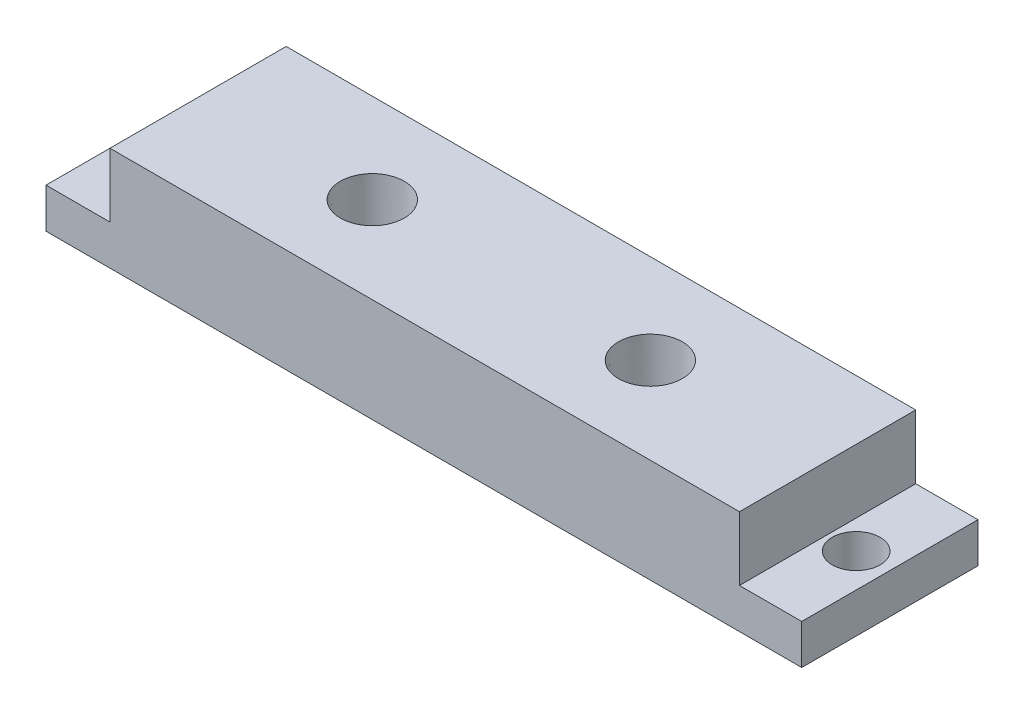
ISO-10303-21;
HEADER;
FILE_DESCRIPTION(('STEP AP214'),'2;1');
FILE_NAME('part.step','',(''),(''),'','','');
FILE_SCHEMA(('AUTOMOTIVE_DESIGN { 1 0 10303 214 1 1 1 1 }'));
ENDSEC;
DATA;
#1=APPLICATION_CONTEXT('core data for automotive mechanical design processes');
#2=APPLICATION_PROTOCOL_DEFINITION('international standard','automotive_design',2000,#1);
#3=PRODUCT_CONTEXT('',#1,'mechanical');
#4=PRODUCT('Part','Part','',(#3));
#5=PRODUCT_RELATED_PRODUCT_CATEGORY('part','',(#4));
#6=PRODUCT_DEFINITION_FORMATION('','',#4);
#7=PRODUCT_DEFINITION_CONTEXT('part definition',#1,'design');
#8=PRODUCT_DEFINITION('design','',#6,#7);
#9=PRODUCT_DEFINITION_SHAPE('','',#8);
#10=(LENGTH_UNIT() NAMED_UNIT(*) SI_UNIT(.MILLI.,.METRE.));
#11=(NAMED_UNIT(*) PLANE_ANGLE_UNIT() SI_UNIT($,.RADIAN.));
#12=(NAMED_UNIT(*) SI_UNIT($,.STERADIAN.) SOLID_ANGLE_UNIT());
#13=UNCERTAINTY_MEASURE_WITH_UNIT(LENGTH_MEASURE(1.E-05),#10,'distance_accuracy_value','');
#14=(GEOMETRIC_REPRESENTATION_CONTEXT(3) GLOBAL_UNCERTAINTY_ASSIGNED_CONTEXT((#13)) GLOBAL_UNIT_ASSIGNED_CONTEXT((#10,
#11,#12)) REPRESENTATION_CONTEXT('',''));
#15=CARTESIAN_POINT('',(0.,0.,0.));
#16=DIRECTION('',(0.,0.,1.));
#17=DIRECTION('',(1.,0.,0.));
#18=AXIS2_PLACEMENT_3D('',#15,#16,#17);
#19=CARTESIAN_POINT('',(-112.70272222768,13.,7.22130923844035));
#20=DIRECTION('',(0.,1.,0.));
#21=DIRECTION('',(0.,0.,1.));
#22=AXIS2_PLACEMENT_3D('',#19,#20,#21);
#23=PLANE('',#22);
#24=DIRECTION('',(0.,0.,1.));
#25=VECTOR('',#24,1.);
#26=CARTESIAN_POINT('',(2.50715548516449,13.,-3.81233545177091));
#27=LINE('',#26,#25);
#28=CARTESIAN_POINT('',(2.50715548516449,13.,-3.81233545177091));
#29=VERTEX_POINT('',#28);
#30=CARTESIAN_POINT('',(2.50715548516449,13.,18.2549539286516));
#31=VERTEX_POINT('',#30);
#32=EDGE_CURVE('E104',#29,#31,#27,.T.);
#33=ORIENTED_EDGE('',*,*,#32,.F.);
#34=DIRECTION('',(1.,0.,0.));
#35=VECTOR('',#34,1.);
#36=CARTESIAN_POINT('',(-112.70272222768,13.,-3.81233545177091));
#37=LINE('',#36,#35);
#38=CARTESIAN_POINT('',(-76.3031514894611,13.,-3.81233545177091));
#39=VERTEX_POINT('',#38);
#40=EDGE_CURVE('E146',#39,#29,#37,.T.);
#41=ORIENTED_EDGE('',*,*,#40,.F.);
#42=DIRECTION('',(0.,0.,1.));
#43=VECTOR('',#42,1.);
#44=CARTESIAN_POINT('',(-76.3031514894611,13.,7.22130923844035));
#45=LINE('',#44,#43);
#46=CARTESIAN_POINT('',(-76.3031514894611,13.,18.2549539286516));
#47=VERTEX_POINT('',#46);
#48=EDGE_CURVE('E125',#39,#47,#45,.T.);
#49=ORIENTED_EDGE('',*,*,#48,.T.);
#50=DIRECTION('',(1.,0.,0.));
#51=VECTOR('',#50,1.);
#52=CARTESIAN_POINT('',(-112.70272222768,13.,18.2549539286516));
#53=LINE('',#52,#51);
#54=EDGE_CURVE('E144',#47,#31,#53,.T.);
#55=ORIENTED_EDGE('',*,*,#54,.T.);
#56=EDGE_LOOP('',(#33,#41,#49,#55));
#57=FACE_BOUND('',#56,.T.);
#58=CARTESIAN_POINT('',(-54.3031514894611,13.,7.40763824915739));
#59=DIRECTION('',(0.,1.,0.));
#60=DIRECTION('',(0.,0.,1.));
#61=AXIS2_PLACEMENT_3D('',#58,#59,#60);
#62=CIRCLE('',#61,4.00000000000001);
#63=CARTESIAN_POINT('',(-54.3031514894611,13.,11.4076382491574));
#64=VERTEX_POINT('',#63);
#65=EDGE_CURVE('E201',#64,#64,#62,.T.);
#66=ORIENTED_EDGE('',*,*,#65,.F.);
#67=EDGE_LOOP('',(#66));
#68=FACE_BOUND('',#67,.T.);
#69=CARTESIAN_POINT('',(-19.4928445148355,13.,7.40763824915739));
#70=DIRECTION('',(0.,-1.,0.));
#71=DIRECTION('',(0.,0.,-1.));
#72=AXIS2_PLACEMENT_3D('',#69,#70,#71);
#73=CIRCLE('',#72,4.00000000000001);
#74=CARTESIAN_POINT('',(-19.4928445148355,13.,3.40763824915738));
#75=VERTEX_POINT('',#74);
#76=EDGE_CURVE('E204',#75,#75,#73,.T.);
#77=ORIENTED_EDGE('',*,*,#76,.T.);
#78=EDGE_LOOP('',(#77));
#79=FACE_BOUND('',#78,.T.);
#80=ADVANCED_FACE('F33',(#57,#68,#79),#23,.T.);
#81=CARTESIAN_POINT('',(10.3014272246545,13.,7.22130923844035));
#82=DIRECTION('',(1.,0.,0.));
#83=DIRECTION('',(0.,0.,-1.));
#84=AXIS2_PLACEMENT_3D('',#81,#82,#83);
#85=PLANE('',#84);
#86=DIRECTION('',(0.,-1.,0.));
#87=VECTOR('',#86,1.);
#88=CARTESIAN_POINT('',(10.3014272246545,13.,-3.81233545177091));
#89=LINE('',#88,#87);
#90=CARTESIAN_POINT('',(10.3014272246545,5.,-3.81233545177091));
#91=VERTEX_POINT('',#90);
#92=CARTESIAN_POINT('',(10.3014272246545,0.,-3.81233545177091));
#93=VERTEX_POINT('',#92);
#94=EDGE_CURVE('E42',#91,#93,#89,.T.);
#95=ORIENTED_EDGE('',*,*,#94,.F.);
#96=DIRECTION('',(0.,0.,1.));
#97=VECTOR('',#96,1.);
#98=CARTESIAN_POINT('',(10.3014272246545,5.,7.22130923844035));
#99=LINE('',#98,#97);
#100=CARTESIAN_POINT('',(10.3014272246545,5.,18.2549539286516));
#101=VERTEX_POINT('',#100);
#102=EDGE_CURVE('E123',#91,#101,#99,.T.);
#103=ORIENTED_EDGE('',*,*,#102,.T.);
#104=DIRECTION('',(0.,-1.,0.));
#105=VECTOR('',#104,1.);
#106=CARTESIAN_POINT('',(10.3014272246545,13.,18.2549539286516));
#107=LINE('',#106,#105);
#108=CARTESIAN_POINT('',(10.3014272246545,0.,18.2549539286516));
#109=VERTEX_POINT('',#108);
#110=EDGE_CURVE('E11',#101,#109,#107,.T.);
#111=ORIENTED_EDGE('',*,*,#110,.T.);
#112=DIRECTION('',(0.,0.,1.));
#113=VECTOR('',#112,1.);
#114=CARTESIAN_POINT('',(10.3014272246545,0.,7.22130923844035));
#115=LINE('',#114,#113);
#116=EDGE_CURVE('E152',#93,#109,#115,.T.);
#117=ORIENTED_EDGE('',*,*,#116,.F.);
#118=EDGE_LOOP('',(#95,#103,#111,#117));
#119=FACE_BOUND('',#118,.T.);
#120=ADVANCED_FACE('F176',(#119),#85,.T.);
#121=CARTESIAN_POINT('',(6.08136965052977,13.,7.22130923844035));
#122=DIRECTION('',(0.,-1.,0.));
#123=DIRECTION('',(0.,0.,-1.));
#124=AXIS2_PLACEMENT_3D('',#121,#122,#123);
#125=CYLINDRICAL_SURFACE('',#124,3.);
#126=CARTESIAN_POINT('',(6.08136965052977,0.,7.22130923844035));
#127=DIRECTION('',(0.,1.,0.));
#128=DIRECTION('',(0.,0.,1.));
#129=AXIS2_PLACEMENT_3D('',#126,#127,#128);
#130=CIRCLE('',#129,3.);
#131=CARTESIAN_POINT('',(6.08136965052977,0.,4.22130923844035));
#132=VERTEX_POINT('',#131);
#133=EDGE_CURVE('E147',#132,#132,#130,.T.);
#134=CARTESIAN_POINT('',(6.08136965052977,5.,7.22130923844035));
#135=DIRECTION('',(0.,1.,0.));
#136=DIRECTION('',(0.,0.,1.));
#137=AXIS2_PLACEMENT_3D('',#134,#135,#136);
#138=CIRCLE('',#137,3.);
#139=CARTESIAN_POINT('',(6.08136965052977,5.,4.22130923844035));
#140=VERTEX_POINT('',#139);
#141=EDGE_CURVE('E37',#140,#140,#138,.T.);
#142=CARTESIAN_POINT('',(6.08136965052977,0.,4.22130923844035));
#143=CARTESIAN_POINT('',(6.08136965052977,0.0520833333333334,4.22130923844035));
#144=CARTESIAN_POINT('',(6.08136965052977,0.104166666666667,4.22130923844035));
#145=CARTESIAN_POINT('',(6.08136965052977,0.208333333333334,4.22130923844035));
#146=CARTESIAN_POINT('',(6.08136965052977,0.260416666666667,4.22130923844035));
#147=CARTESIAN_POINT('',(6.08136965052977,0.364583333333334,4.22130923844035));
#148=CARTESIAN_POINT('',(6.08136965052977,0.416666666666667,4.22130923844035));
#149=CARTESIAN_POINT('',(6.08136965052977,0.520833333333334,4.22130923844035));
#150=CARTESIAN_POINT('',(6.08136965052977,0.572916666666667,4.22130923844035));
#151=CARTESIAN_POINT('',(6.08136965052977,0.677083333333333,4.22130923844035));
#152=CARTESIAN_POINT('',(6.08136965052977,0.729166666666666,4.22130923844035));
#153=CARTESIAN_POINT('',(6.08136965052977,0.833333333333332,4.22130923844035));
#154=CARTESIAN_POINT('',(6.08136965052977,0.885416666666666,4.22130923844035));
#155=CARTESIAN_POINT('',(6.08136965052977,0.989583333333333,4.22130923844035));
#156=CARTESIAN_POINT('',(6.08136965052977,1.04166666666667,4.22130923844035));
#157=CARTESIAN_POINT('',(6.08136965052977,1.14583333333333,4.22130923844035));
#158=CARTESIAN_POINT('',(6.08136965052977,1.19791666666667,4.22130923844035));
#159=CARTESIAN_POINT('',(6.08136965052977,1.30208333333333,4.22130923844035));
#160=CARTESIAN_POINT('',(6.08136965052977,1.35416666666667,4.22130923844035));
#161=CARTESIAN_POINT('',(6.08136965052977,1.45833333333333,4.22130923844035));
#162=CARTESIAN_POINT('',(6.08136965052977,1.51041666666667,4.22130923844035));
#163=CARTESIAN_POINT('',(6.08136965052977,1.61458333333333,4.22130923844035));
#164=CARTESIAN_POINT('',(6.08136965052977,1.66666666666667,4.22130923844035));
#165=CARTESIAN_POINT('',(6.08136965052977,1.77083333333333,4.22130923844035));
#166=CARTESIAN_POINT('',(6.08136965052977,1.82291666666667,4.22130923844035));
#167=CARTESIAN_POINT('',(6.08136965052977,1.92708333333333,4.22130923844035));
#168=CARTESIAN_POINT('',(6.08136965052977,1.97916666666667,4.22130923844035));
#169=CARTESIAN_POINT('',(6.08136965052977,2.08333333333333,4.22130923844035));
#170=CARTESIAN_POINT('',(6.08136965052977,2.13541666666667,4.22130923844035));
#171=CARTESIAN_POINT('',(6.08136965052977,2.23958333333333,4.22130923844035));
#172=CARTESIAN_POINT('',(6.08136965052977,2.29166666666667,4.22130923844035));
#173=CARTESIAN_POINT('',(6.08136965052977,2.39583333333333,4.22130923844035));
#174=CARTESIAN_POINT('',(6.08136965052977,2.44791666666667,4.22130923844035));
#175=CARTESIAN_POINT('',(6.08136965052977,2.55208333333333,4.22130923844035));
#176=CARTESIAN_POINT('',(6.08136965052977,2.60416666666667,4.22130923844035));
#177=CARTESIAN_POINT('',(6.08136965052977,2.70833333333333,4.22130923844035));
#178=CARTESIAN_POINT('',(6.08136965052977,2.76041666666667,4.22130923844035));
#179=CARTESIAN_POINT('',(6.08136965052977,2.86458333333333,4.22130923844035));
#180=CARTESIAN_POINT('',(6.08136965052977,2.91666666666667,4.22130923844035));
#181=CARTESIAN_POINT('',(6.08136965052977,3.02083333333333,4.22130923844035));
#182=CARTESIAN_POINT('',(6.08136965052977,3.07291666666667,4.22130923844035));
#183=CARTESIAN_POINT('',(6.08136965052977,3.17708333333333,4.22130923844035));
#184=CARTESIAN_POINT('',(6.08136965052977,3.22916666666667,4.22130923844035));
#185=CARTESIAN_POINT('',(6.08136965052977,3.33333333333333,4.22130923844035));
#186=CARTESIAN_POINT('',(6.08136965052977,3.38541666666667,4.22130923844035));
#187=CARTESIAN_POINT('',(6.08136965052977,3.48958333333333,4.22130923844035));
#188=CARTESIAN_POINT('',(6.08136965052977,3.54166666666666,4.22130923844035));
#189=CARTESIAN_POINT('',(6.08136965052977,3.64583333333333,4.22130923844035));
#190=CARTESIAN_POINT('',(6.08136965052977,3.69791666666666,4.22130923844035));
#191=CARTESIAN_POINT('',(6.08136965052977,3.80208333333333,4.22130923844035));
#192=CARTESIAN_POINT('',(6.08136965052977,3.85416666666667,4.22130923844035));
#193=CARTESIAN_POINT('',(6.08136965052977,3.95833333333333,4.22130923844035));
#194=CARTESIAN_POINT('',(6.08136965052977,4.01041666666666,4.22130923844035));
#195=CARTESIAN_POINT('',(6.08136965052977,4.11458333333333,4.22130923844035));
#196=CARTESIAN_POINT('',(6.08136965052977,4.16666666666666,4.22130923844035));
#197=CARTESIAN_POINT('',(6.08136965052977,4.27083333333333,4.22130923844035));
#198=CARTESIAN_POINT('',(6.08136965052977,4.32291666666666,4.22130923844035));
#199=CARTESIAN_POINT('',(6.08136965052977,4.42708333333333,4.22130923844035));
#200=CARTESIAN_POINT('',(6.08136965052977,4.47916666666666,4.22130923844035));
#201=CARTESIAN_POINT('',(6.08136965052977,4.58333333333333,4.22130923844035));
#202=CARTESIAN_POINT('',(6.08136965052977,4.63541666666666,4.22130923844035));
#203=CARTESIAN_POINT('',(6.08136965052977,4.73958333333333,4.22130923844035));
#204=CARTESIAN_POINT('',(6.08136965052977,4.79166666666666,4.22130923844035));
#205=CARTESIAN_POINT('',(6.08136965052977,4.89583333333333,4.22130923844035));
#206=CARTESIAN_POINT('',(6.08136965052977,4.94791666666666,4.22130923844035));
#207=CARTESIAN_POINT('',(6.08136965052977,5.,4.22130923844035));
#208=B_SPLINE_CURVE_WITH_KNOTS('',3,(#142,#143,#144,#145,#146,#147,#148,#149,#150,#151,#152,
#153,#154,#155,#156,#157,#158,#159,#160,#161,#162,#163,#164,#165,#166,#167,#168,#169,#170,#171,
#172,#173,#174,#175,#176,#177,#178,#179,#180,#181,#182,#183,#184,#185,#186,#187,#188,#189,#190,
#191,#192,#193,#194,#195,#196,#197,#198,#199,#200,#201,#202,#203,#204,#205,#206,#207),
.UNSPECIFIED.,.F.,.F.,(4,2,2,2,2,2,2,2,2,2,2,2,2,2,2,2,2,2,2,2,2,2,2,2,2,2,2,2,2,2,2,2,4),(0.,
0.15625,0.3125,0.46875,0.625000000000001,0.781249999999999,0.937499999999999,1.09375,1.25,
1.40625,1.5625,1.71875,1.875,2.03125,2.1875,2.34375,2.5,2.65625,2.8125,2.96875,3.125,3.28125,
3.4375,3.59375,3.75,3.90625,4.0625,4.21875,4.375,4.53125,4.6875,4.84375,5.),.UNSPECIFIED.);
#209=EDGE_CURVE('BSEAM238',#132,#140,#208,.T.);
#210=ORIENTED_EDGE('',*,*,#133,.F.);
#211=ORIENTED_EDGE('',*,*,#141,.T.);
#212=ORIENTED_EDGE('',*,*,#209,.T.);
#213=ORIENTED_EDGE('',*,*,#209,.F.);
#214=EDGE_LOOP('',(#210,#212,#211,#213));
#215=FACE_BOUND('',#214,.T.);
#216=ADVANCED_FACE('F238',(#215),#125,.F.);
#217=CARTESIAN_POINT('',(-112.70272222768,13.,18.2549539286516));
#218=DIRECTION('',(0.,0.,-1.));
#219=DIRECTION('',(-1.,0.,0.));
#220=AXIS2_PLACEMENT_3D('',#217,#218,#219);
#221=PLANE('',#220);
#222=DIRECTION('',(1.,0.,0.));
#223=VECTOR('',#222,1.);
#224=CARTESIAN_POINT('',(2.50715548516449,5.,18.2549539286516));
#225=LINE('',#224,#223);
#226=CARTESIAN_POINT('',(2.50715548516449,5.,18.2549539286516));
#227=VERTEX_POINT('',#226);
#228=EDGE_CURVE('E49',#227,#101,#225,.T.);
#229=ORIENTED_EDGE('',*,*,#228,.F.);
#230=DIRECTION('',(0.,1.,0.));
#231=VECTOR('',#230,1.);
#232=CARTESIAN_POINT('',(2.50715548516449,5.,18.2549539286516));
#233=LINE('',#232,#231);
#234=EDGE_CURVE('E99',#227,#31,#233,.T.);
#235=ORIENTED_EDGE('',*,*,#234,.T.);
#236=ORIENTED_EDGE('',*,*,#54,.F.);
#237=DIRECTION('',(0.,1.,0.));
#238=VECTOR('',#237,1.);
#239=CARTESIAN_POINT('',(-76.3031514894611,5.,18.2549539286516));
#240=LINE('',#239,#238);
#241=CARTESIAN_POINT('',(-76.3031514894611,5.,18.2549539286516));
#242=VERTEX_POINT('',#241);
#243=EDGE_CURVE('E57',#242,#47,#240,.T.);
#244=ORIENTED_EDGE('',*,*,#243,.F.);
#245=DIRECTION('',(1.,0.,0.));
#246=VECTOR('',#245,1.);
#247=CARTESIAN_POINT('',(-112.70272222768,5.,18.2549539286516));
#248=LINE('',#247,#246);
#249=CARTESIAN_POINT('',(-84.3031514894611,5.,18.2549539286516));
#250=VERTEX_POINT('',#249);
#251=EDGE_CURVE('E132',#250,#242,#248,.T.);
#252=ORIENTED_EDGE('',*,*,#251,.F.);
#253=DIRECTION('',(0.,-1.,0.));
#254=VECTOR('',#253,1.);
#255=CARTESIAN_POINT('',(-84.3031514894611,13.,18.2549539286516));
#256=LINE('',#255,#254);
#257=CARTESIAN_POINT('',(-84.3031514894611,0.,18.2549539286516));
#258=VERTEX_POINT('',#257);
#259=EDGE_CURVE('E150',#250,#258,#256,.T.);
#260=ORIENTED_EDGE('',*,*,#259,.T.);
#261=DIRECTION('',(1.,0.,0.));
#262=VECTOR('',#261,1.);
#263=CARTESIAN_POINT('',(-112.70272222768,0.,18.2549539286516));
#264=LINE('',#263,#262);
#265=EDGE_CURVE('E141',#258,#109,#264,.T.);
#266=ORIENTED_EDGE('',*,*,#265,.T.);
#267=ORIENTED_EDGE('',*,*,#110,.F.);
#268=EDGE_LOOP('',(#229,#235,#236,#244,#252,#260,#266,#267));
#269=FACE_BOUND('',#268,.T.);
#270=ADVANCED_FACE('F35',(#269),#221,.F.);
#271=CARTESIAN_POINT('',(-112.70272222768,13.,-3.81233545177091));
#272=DIRECTION('',(0.,0.,-1.));
#273=DIRECTION('',(-1.,0.,0.));
#274=AXIS2_PLACEMENT_3D('',#271,#272,#273);
#275=PLANE('',#274);
#276=DIRECTION('',(0.,1.,0.));
#277=VECTOR('',#276,1.);
#278=CARTESIAN_POINT('',(2.50715548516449,5.,-3.81233545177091));
#279=LINE('',#278,#277);
#280=CARTESIAN_POINT('',(2.50715548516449,5.,-3.81233545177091));
#281=VERTEX_POINT('',#280);
#282=EDGE_CURVE('E108',#281,#29,#279,.T.);
#283=ORIENTED_EDGE('',*,*,#282,.F.);
#284=DIRECTION('',(-1.,0.,0.));
#285=VECTOR('',#284,1.);
#286=CARTESIAN_POINT('',(2.50715548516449,5.,-3.81233545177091));
#287=LINE('',#286,#285);
#288=EDGE_CURVE('E109',#91,#281,#287,.T.);
#289=ORIENTED_EDGE('',*,*,#288,.F.);
#290=ORIENTED_EDGE('',*,*,#94,.T.);
#291=DIRECTION('',(1.,0.,0.));
#292=VECTOR('',#291,1.);
#293=CARTESIAN_POINT('',(-112.70272222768,0.,-3.81233545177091));
#294=LINE('',#293,#292);
#295=CARTESIAN_POINT('',(-84.3031514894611,0.,-3.81233545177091));
#296=VERTEX_POINT('',#295);
#297=EDGE_CURVE('E155',#296,#93,#294,.T.);
#298=ORIENTED_EDGE('',*,*,#297,.F.);
#299=DIRECTION('',(0.,-1.,0.));
#300=VECTOR('',#299,1.);
#301=CARTESIAN_POINT('',(-84.3031514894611,13.,-3.81233545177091));
#302=LINE('',#301,#300);
#303=CARTESIAN_POINT('',(-84.3031514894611,5.,-3.81233545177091));
#304=VERTEX_POINT('',#303);
#305=EDGE_CURVE('E167',#304,#296,#302,.T.);
#306=ORIENTED_EDGE('',*,*,#305,.F.);
#307=DIRECTION('',(-1.,0.,0.));
#308=VECTOR('',#307,1.);
#309=CARTESIAN_POINT('',(-112.70272222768,5.,-3.81233545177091));
#310=LINE('',#309,#308);
#311=CARTESIAN_POINT('',(-76.3031514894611,5.,-3.81233545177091));
#312=VERTEX_POINT('',#311);
#313=EDGE_CURVE('E128',#312,#304,#310,.T.);
#314=ORIENTED_EDGE('',*,*,#313,.F.);
#315=DIRECTION('',(0.,1.,0.));
#316=VECTOR('',#315,1.);
#317=CARTESIAN_POINT('',(-76.3031514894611,5.,-3.81233545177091));
#318=LINE('',#317,#316);
#319=EDGE_CURVE('E138',#312,#39,#318,.T.);
#320=ORIENTED_EDGE('',*,*,#319,.T.);
#321=ORIENTED_EDGE('',*,*,#40,.T.);
#322=EDGE_LOOP('',(#283,#289,#290,#298,#306,#314,#320,#321));
#323=FACE_BOUND('',#322,.T.);
#324=ADVANCED_FACE('F173',(#323),#275,.T.);
#325=CARTESIAN_POINT('',(-80.1837497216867,13.,7.22130923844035));
#326=DIRECTION('',(0.,-1.,0.));
#327=DIRECTION('',(0.,0.,-1.));
#328=AXIS2_PLACEMENT_3D('',#325,#326,#327);
#329=CYLINDRICAL_SURFACE('',#328,3.03623271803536);
#330=CARTESIAN_POINT('',(-80.1837497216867,0.,7.22130923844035));
#331=DIRECTION('',(0.,1.,0.));
#332=DIRECTION('',(0.,0.,1.));
#333=AXIS2_PLACEMENT_3D('',#330,#331,#332);
#334=CIRCLE('',#333,3.03623271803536);
#335=CARTESIAN_POINT('',(-80.1837497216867,0.,4.18507652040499));
#336=VERTEX_POINT('',#335);
#337=EDGE_CURVE('E161',#336,#336,#334,.T.);
#338=CARTESIAN_POINT('',(-80.1837497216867,5.,7.22130923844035));
#339=DIRECTION('',(0.,1.,0.));
#340=DIRECTION('',(0.,0.,1.));
#341=AXIS2_PLACEMENT_3D('',#338,#339,#340);
#342=CIRCLE('',#341,3.03623271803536);
#343=CARTESIAN_POINT('',(-80.1837497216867,5.,4.18507652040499));
#344=VERTEX_POINT('',#343);
#345=EDGE_CURVE('E135',#344,#344,#342,.F.);
#346=CARTESIAN_POINT('',(-80.1837497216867,0.,4.18507652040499));
#347=CARTESIAN_POINT('',(-80.1837497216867,0.0520833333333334,4.18507652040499));
#348=CARTESIAN_POINT('',(-80.1837497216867,0.104166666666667,4.18507652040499));
#349=CARTESIAN_POINT('',(-80.1837497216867,0.208333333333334,4.18507652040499));
#350=CARTESIAN_POINT('',(-80.1837497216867,0.260416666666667,4.18507652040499));
#351=CARTESIAN_POINT('',(-80.1837497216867,0.364583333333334,4.18507652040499));
#352=CARTESIAN_POINT('',(-80.1837497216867,0.416666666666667,4.18507652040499));
#353=CARTESIAN_POINT('',(-80.1837497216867,0.520833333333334,4.18507652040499));
#354=CARTESIAN_POINT('',(-80.1837497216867,0.572916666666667,4.18507652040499));
#355=CARTESIAN_POINT('',(-80.1837497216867,0.677083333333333,4.18507652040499));
#356=CARTESIAN_POINT('',(-80.1837497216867,0.729166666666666,4.18507652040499));
#357=CARTESIAN_POINT('',(-80.1837497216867,0.833333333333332,4.18507652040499));
#358=CARTESIAN_POINT('',(-80.1837497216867,0.885416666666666,4.18507652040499));
#359=CARTESIAN_POINT('',(-80.1837497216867,0.989583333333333,4.18507652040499));
#360=CARTESIAN_POINT('',(-80.1837497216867,1.04166666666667,4.18507652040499));
#361=CARTESIAN_POINT('',(-80.1837497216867,1.14583333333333,4.18507652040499));
#362=CARTESIAN_POINT('',(-80.1837497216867,1.19791666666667,4.18507652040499));
#363=CARTESIAN_POINT('',(-80.1837497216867,1.30208333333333,4.18507652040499));
#364=CARTESIAN_POINT('',(-80.1837497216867,1.35416666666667,4.18507652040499));
#365=CARTESIAN_POINT('',(-80.1837497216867,1.45833333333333,4.18507652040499));
#366=CARTESIAN_POINT('',(-80.1837497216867,1.51041666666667,4.18507652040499));
#367=CARTESIAN_POINT('',(-80.1837497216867,1.61458333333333,4.18507652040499));
#368=CARTESIAN_POINT('',(-80.1837497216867,1.66666666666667,4.18507652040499));
#369=CARTESIAN_POINT('',(-80.1837497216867,1.77083333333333,4.18507652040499));
#370=CARTESIAN_POINT('',(-80.1837497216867,1.82291666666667,4.18507652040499));
#371=CARTESIAN_POINT('',(-80.1837497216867,1.92708333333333,4.18507652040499));
#372=CARTESIAN_POINT('',(-80.1837497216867,1.97916666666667,4.18507652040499));
#373=CARTESIAN_POINT('',(-80.1837497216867,2.08333333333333,4.18507652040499));
#374=CARTESIAN_POINT('',(-80.1837497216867,2.13541666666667,4.18507652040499));
#375=CARTESIAN_POINT('',(-80.1837497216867,2.23958333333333,4.18507652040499));
#376=CARTESIAN_POINT('',(-80.1837497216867,2.29166666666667,4.18507652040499));
#377=CARTESIAN_POINT('',(-80.1837497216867,2.39583333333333,4.18507652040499));
#378=CARTESIAN_POINT('',(-80.1837497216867,2.44791666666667,4.18507652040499));
#379=CARTESIAN_POINT('',(-80.1837497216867,2.55208333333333,4.18507652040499));
#380=CARTESIAN_POINT('',(-80.1837497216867,2.60416666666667,4.18507652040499));
#381=CARTESIAN_POINT('',(-80.1837497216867,2.70833333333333,4.18507652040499));
#382=CARTESIAN_POINT('',(-80.1837497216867,2.76041666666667,4.18507652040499));
#383=CARTESIAN_POINT('',(-80.1837497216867,2.86458333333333,4.18507652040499));
#384=CARTESIAN_POINT('',(-80.1837497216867,2.91666666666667,4.18507652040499));
#385=CARTESIAN_POINT('',(-80.1837497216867,3.02083333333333,4.18507652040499));
#386=CARTESIAN_POINT('',(-80.1837497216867,3.07291666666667,4.18507652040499));
#387=CARTESIAN_POINT('',(-80.1837497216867,3.17708333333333,4.18507652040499));
#388=CARTESIAN_POINT('',(-80.1837497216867,3.22916666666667,4.18507652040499));
#389=CARTESIAN_POINT('',(-80.1837497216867,3.33333333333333,4.18507652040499));
#390=CARTESIAN_POINT('',(-80.1837497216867,3.38541666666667,4.18507652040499));
#391=CARTESIAN_POINT('',(-80.1837497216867,3.48958333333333,4.18507652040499));
#392=CARTESIAN_POINT('',(-80.1837497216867,3.54166666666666,4.18507652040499));
#393=CARTESIAN_POINT('',(-80.1837497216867,3.64583333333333,4.18507652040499));
#394=CARTESIAN_POINT('',(-80.1837497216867,3.69791666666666,4.18507652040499));
#395=CARTESIAN_POINT('',(-80.1837497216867,3.80208333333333,4.18507652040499));
#396=CARTESIAN_POINT('',(-80.1837497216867,3.85416666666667,4.18507652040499));
#397=CARTESIAN_POINT('',(-80.1837497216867,3.95833333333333,4.18507652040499));
#398=CARTESIAN_POINT('',(-80.1837497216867,4.01041666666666,4.18507652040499));
#399=CARTESIAN_POINT('',(-80.1837497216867,4.11458333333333,4.18507652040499));
#400=CARTESIAN_POINT('',(-80.1837497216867,4.16666666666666,4.18507652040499));
#401=CARTESIAN_POINT('',(-80.1837497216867,4.27083333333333,4.18507652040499));
#402=CARTESIAN_POINT('',(-80.1837497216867,4.32291666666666,4.18507652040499));
#403=CARTESIAN_POINT('',(-80.1837497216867,4.42708333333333,4.18507652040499));
#404=CARTESIAN_POINT('',(-80.1837497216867,4.47916666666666,4.18507652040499));
#405=CARTESIAN_POINT('',(-80.1837497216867,4.58333333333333,4.18507652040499));
#406=CARTESIAN_POINT('',(-80.1837497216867,4.63541666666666,4.18507652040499));
#407=CARTESIAN_POINT('',(-80.1837497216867,4.73958333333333,4.18507652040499));
#408=CARTESIAN_POINT('',(-80.1837497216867,4.79166666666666,4.18507652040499));
#409=CARTESIAN_POINT('',(-80.1837497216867,4.89583333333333,4.18507652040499));
#410=CARTESIAN_POINT('',(-80.1837497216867,4.94791666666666,4.18507652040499));
#411=CARTESIAN_POINT('',(-80.1837497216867,5.,4.18507652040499));
#412=B_SPLINE_CURVE_WITH_KNOTS('',3,(#346,#347,#348,#349,#350,#351,#352,#353,#354,#355,#356,
#357,#358,#359,#360,#361,#362,#363,#364,#365,#366,#367,#368,#369,#370,#371,#372,#373,#374,#375,
#376,#377,#378,#379,#380,#381,#382,#383,#384,#385,#386,#387,#388,#389,#390,#391,#392,#393,#394,
#395,#396,#397,#398,#399,#400,#401,#402,#403,#404,#405,#406,#407,#408,#409,#410,#411),
.UNSPECIFIED.,.F.,.F.,(4,2,2,2,2,2,2,2,2,2,2,2,2,2,2,2,2,2,2,2,2,2,2,2,2,2,2,2,2,2,2,2,4),(0.,
0.15625,0.3125,0.46875,0.625000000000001,0.781249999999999,0.937499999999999,1.09375,1.25,
1.40625,1.5625,1.71875,1.875,2.03125,2.1875,2.34375,2.5,2.65625,2.8125,2.96875,3.125,3.28125,
3.4375,3.59375,3.75,3.90625,4.0625,4.21875,4.375,4.53125,4.6875,4.84375,5.),.UNSPECIFIED.);
#413=EDGE_CURVE('BSEAM242',#336,#344,#412,.T.);
#414=ORIENTED_EDGE('',*,*,#337,.F.);
#415=ORIENTED_EDGE('',*,*,#345,.F.);
#416=ORIENTED_EDGE('',*,*,#413,.T.);
#417=ORIENTED_EDGE('',*,*,#413,.F.);
#418=EDGE_LOOP('',(#414,#416,#415,#417));
#419=FACE_BOUND('',#418,.T.);
#420=ADVANCED_FACE('F242',(#419),#329,.F.);
#421=CARTESIAN_POINT('',(-84.3031514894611,13.,7.22130923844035));
#422=DIRECTION('',(1.,0.,0.));
#423=DIRECTION('',(0.,0.,-1.));
#424=AXIS2_PLACEMENT_3D('',#421,#422,#423);
#425=PLANE('',#424);
#426=DIRECTION('',(0.,0.,1.));
#427=VECTOR('',#426,1.);
#428=CARTESIAN_POINT('',(-84.3031514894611,5.,7.22130923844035));
#429=LINE('',#428,#427);
#430=EDGE_CURVE('E130',#304,#250,#429,.T.);
#431=ORIENTED_EDGE('',*,*,#430,.F.);
#432=ORIENTED_EDGE('',*,*,#305,.T.);
#433=DIRECTION('',(0.,0.,1.));
#434=VECTOR('',#433,1.);
#435=CARTESIAN_POINT('',(-84.3031514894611,0.,7.22130923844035));
#436=LINE('',#435,#434);
#437=EDGE_CURVE('E158',#296,#258,#436,.T.);
#438=ORIENTED_EDGE('',*,*,#437,.T.);
#439=ORIENTED_EDGE('',*,*,#259,.F.);
#440=EDGE_LOOP('',(#431,#432,#438,#439));
#441=FACE_BOUND('',#440,.T.);
#442=ADVANCED_FACE('F185',(#441),#425,.F.);
#443=CARTESIAN_POINT('',(-112.70272222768,0.,7.22130923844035));
#444=DIRECTION('',(0.,1.,0.));
#445=DIRECTION('',(0.,0.,1.));
#446=AXIS2_PLACEMENT_3D('',#443,#444,#445);
#447=PLANE('',#446);
#448=ORIENTED_EDGE('',*,*,#265,.F.);
#449=ORIENTED_EDGE('',*,*,#437,.F.);
#450=ORIENTED_EDGE('',*,*,#297,.T.);
#451=ORIENTED_EDGE('',*,*,#116,.T.);
#452=EDGE_LOOP('',(#448,#449,#450,#451));
#453=FACE_BOUND('',#452,.T.);
#454=ORIENTED_EDGE('',*,*,#337,.T.);
#455=EDGE_LOOP('',(#454));
#456=FACE_BOUND('',#455,.T.);
#457=ORIENTED_EDGE('',*,*,#133,.T.);
#458=EDGE_LOOP('',(#457));
#459=FACE_BOUND('',#458,.T.);
#460=ADVANCED_FACE('F180',(#453,#456,#459),#447,.F.);
#461=CARTESIAN_POINT('',(-76.3031514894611,5.,7.22130923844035));
#462=DIRECTION('',(-1.,0.,0.));
#463=DIRECTION('',(0.,0.,1.));
#464=AXIS2_PLACEMENT_3D('',#461,#462,#463);
#465=PLANE('',#464);
#466=ORIENTED_EDGE('',*,*,#48,.F.);
#467=ORIENTED_EDGE('',*,*,#319,.F.);
#468=DIRECTION('',(0.,0.,1.));
#469=VECTOR('',#468,1.);
#470=CARTESIAN_POINT('',(-76.3031514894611,5.,7.22130923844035));
#471=LINE('',#470,#469);
#472=EDGE_CURVE('E126',#312,#242,#471,.T.);
#473=ORIENTED_EDGE('',*,*,#472,.T.);
#474=ORIENTED_EDGE('',*,*,#243,.T.);
#475=EDGE_LOOP('',(#466,#467,#473,#474));
#476=FACE_BOUND('',#475,.T.);
#477=ADVANCED_FACE('F193',(#476),#465,.T.);
#478=CARTESIAN_POINT('',(-112.70272222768,5.,7.22130923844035));
#479=DIRECTION('',(0.,1.,0.));
#480=DIRECTION('',(0.,0.,1.));
#481=AXIS2_PLACEMENT_3D('',#478,#479,#480);
#482=PLANE('',#481);
#483=ORIENTED_EDGE('',*,*,#472,.F.);
#484=ORIENTED_EDGE('',*,*,#313,.T.);
#485=ORIENTED_EDGE('',*,*,#430,.T.);
#486=ORIENTED_EDGE('',*,*,#251,.T.);
#487=EDGE_LOOP('',(#483,#484,#485,#486));
#488=FACE_BOUND('',#487,.T.);
#489=ORIENTED_EDGE('',*,*,#345,.T.);
#490=EDGE_LOOP('',(#489));
#491=FACE_BOUND('',#490,.T.);
#492=ADVANCED_FACE('F190',(#488,#491),#482,.T.);
#493=CARTESIAN_POINT('',(2.50715548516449,5.,-3.81233545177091));
#494=DIRECTION('',(-1.,0.,0.));
#495=DIRECTION('',(0.,0.,1.));
#496=AXIS2_PLACEMENT_3D('',#493,#494,#495);
#497=PLANE('',#496);
#498=ORIENTED_EDGE('',*,*,#32,.T.);
#499=ORIENTED_EDGE('',*,*,#234,.F.);
#500=DIRECTION('',(0.,0.,1.));
#501=VECTOR('',#500,1.);
#502=CARTESIAN_POINT('',(2.50715548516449,5.,-3.81233545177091));
#503=LINE('',#502,#501);
#504=EDGE_CURVE('E101',#281,#227,#503,.T.);
#505=ORIENTED_EDGE('',*,*,#504,.F.);
#506=ORIENTED_EDGE('',*,*,#282,.T.);
#507=EDGE_LOOP('',(#498,#499,#505,#506));
#508=FACE_BOUND('',#507,.T.);
#509=ADVANCED_FACE('F100',(#508),#497,.F.);
#510=CARTESIAN_POINT('',(2.50715548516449,5.,18.2549539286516));
#511=DIRECTION('',(0.,1.,0.));
#512=DIRECTION('',(0.,0.,1.));
#513=AXIS2_PLACEMENT_3D('',#510,#511,#512);
#514=PLANE('',#513);
#515=ORIENTED_EDGE('',*,*,#141,.F.);
#516=EDGE_LOOP('',(#515));
#517=FACE_BOUND('',#516,.T.);
#518=ORIENTED_EDGE('',*,*,#288,.T.);
#519=ORIENTED_EDGE('',*,*,#504,.T.);
#520=ORIENTED_EDGE('',*,*,#228,.T.);
#521=ORIENTED_EDGE('',*,*,#102,.F.);
#522=EDGE_LOOP('',(#518,#519,#520,#521));
#523=FACE_BOUND('',#522,.T.);
#524=ADVANCED_FACE('F111',(#517,#523),#514,.T.);
#525=CARTESIAN_POINT('',(-54.3031514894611,13.,7.40763824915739));
#526=DIRECTION('',(0.,1.,0.));
#527=DIRECTION('',(0.,0.,1.));
#528=AXIS2_PLACEMENT_3D('',#525,#526,#527);
#529=CONICAL_SURFACE('',#528,4.00000000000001,0.0174532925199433);
#530=CARTESIAN_POINT('',(-54.3031514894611,3.,7.40763824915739));
#531=DIRECTION('',(0.,1.,0.));
#532=DIRECTION('',(0.,0.,1.));
#533=AXIS2_PLACEMENT_3D('',#530,#531,#532);
#534=CIRCLE('',#533,3.82544935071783);
#535=CARTESIAN_POINT('',(-54.3031514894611,3.,11.2330875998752));
#536=VERTEX_POINT('',#535);
#537=EDGE_CURVE('E121',#536,#536,#534,.T.);
#538=ORIENTED_EDGE('',*,*,#537,.F.);
#539=EDGE_LOOP('',(#538));
#540=FACE_BOUND('',#539,.T.);
#541=ORIENTED_EDGE('',*,*,#65,.T.);
#542=EDGE_LOOP('',(#541));
#543=FACE_BOUND('',#542,.T.);
#544=ADVANCED_FACE('F216',(#540,#543),#529,.F.);
#545=CARTESIAN_POINT('',(-54.3031514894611,3.,7.40763824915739));
#546=DIRECTION('',(0.,1.,0.));
#547=DIRECTION('',(0.,0.,1.));
#548=AXIS2_PLACEMENT_3D('',#545,#546,#547);
#549=PLANE('',#548);
#550=ORIENTED_EDGE('',*,*,#537,.T.);
#551=EDGE_LOOP('',(#550));
#552=FACE_BOUND('',#551,.T.);
#553=ADVANCED_FACE('F214',(#552),#549,.T.);
#554=CARTESIAN_POINT('',(-19.4928445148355,13.,7.40763824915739));
#555=DIRECTION('',(0.,1.,0.));
#556=DIRECTION('',(0.,0.,-1.));
#557=AXIS2_PLACEMENT_3D('',#554,#555,#556);
#558=CONICAL_SURFACE('',#557,4.00000000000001,0.0174532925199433);
#559=CARTESIAN_POINT('',(-19.4928445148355,3.,7.40763824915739));
#560=DIRECTION('',(0.,-1.,0.));
#561=DIRECTION('',(0.,0.,-1.));
#562=AXIS2_PLACEMENT_3D('',#559,#560,#561);
#563=CIRCLE('',#562,3.82544935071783);
#564=CARTESIAN_POINT('',(-19.4928445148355,3.,3.58218889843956));
#565=VERTEX_POINT('',#564);
#566=EDGE_CURVE('E206',#565,#565,#563,.T.);
#567=ORIENTED_EDGE('',*,*,#566,.T.);
#568=EDGE_LOOP('',(#567));
#569=FACE_BOUND('',#568,.T.);
#570=ORIENTED_EDGE('',*,*,#76,.F.);
#571=EDGE_LOOP('',(#570));
#572=FACE_BOUND('',#571,.T.);
#573=ADVANCED_FACE('F224',(#569,#572),#558,.F.);
#574=CARTESIAN_POINT('',(-19.4928445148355,3.,7.40763824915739));
#575=DIRECTION('',(0.,-1.,0.));
#576=DIRECTION('',(0.,0.,-1.));
#577=AXIS2_PLACEMENT_3D('',#574,#575,#576);
#578=PLANE('',#577);
#579=ORIENTED_EDGE('',*,*,#566,.F.);
#580=EDGE_LOOP('',(#579));
#581=FACE_BOUND('',#580,.T.);
#582=ADVANCED_FACE('F326',(#581),#578,.F.);
#583=CLOSED_SHELL('',(#80,#120,#216,#270,#324,#420,#442,#460,#477,#492,#509,#524,#544,#553,#573,#582));
#584=MANIFOLD_SOLID_BREP('B2',#583);
#585=ADVANCED_BREP_SHAPE_REPRESENTATION('',(#18,#584),#14);
#586=SHAPE_DEFINITION_REPRESENTATION(#9,#585);
ENDSEC;
END-ISO-10303-21;
